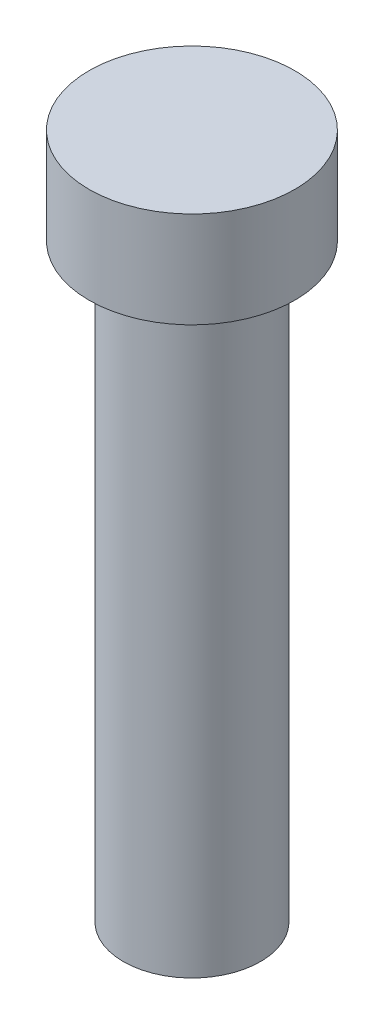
from build123d import *


with BuildPart() as part:
    # Sketch1 → Revolve1 (revolve)
    with BuildSketch(Plane.XY, mode=Mode.PRIVATE) as revolve1_sk:
        Polygon((0, 0), (7.5, 0), (7.5, -7), (5, -7), (5, -50), (0, -50), align=None)
    revolve(revolve1_sk.sketch.rotate(Axis((0, 0, 0), (0, -1, 0)), 90), axis=Axis((0, 0, 0), (0, -1, 0)))


solid = part.part
